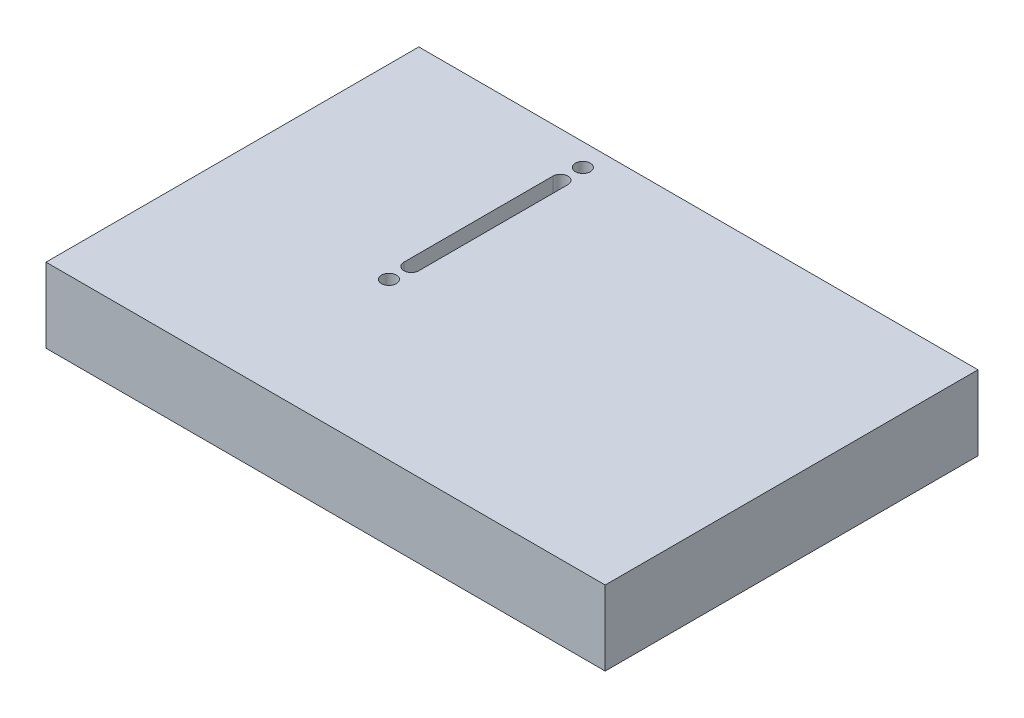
ISO-10303-21;
HEADER;
FILE_DESCRIPTION(('STEP AP214'),'2;1');
FILE_NAME('part.step','',(''),(''),'','','');
FILE_SCHEMA(('AUTOMOTIVE_DESIGN { 1 0 10303 214 1 1 1 1 }'));
ENDSEC;
DATA;
#1=APPLICATION_CONTEXT('core data for automotive mechanical design processes');
#2=APPLICATION_PROTOCOL_DEFINITION('international standard','automotive_design',2000,#1);
#3=PRODUCT_CONTEXT('',#1,'mechanical');
#4=PRODUCT('Part','Part','',(#3));
#5=PRODUCT_RELATED_PRODUCT_CATEGORY('part','',(#4));
#6=PRODUCT_DEFINITION_FORMATION('','',#4);
#7=PRODUCT_DEFINITION_CONTEXT('part definition',#1,'design');
#8=PRODUCT_DEFINITION('design','',#6,#7);
#9=PRODUCT_DEFINITION_SHAPE('','',#8);
#10=(LENGTH_UNIT() NAMED_UNIT(*) SI_UNIT(.MILLI.,.METRE.));
#11=(NAMED_UNIT(*) PLANE_ANGLE_UNIT() SI_UNIT($,.RADIAN.));
#12=(NAMED_UNIT(*) SI_UNIT($,.STERADIAN.) SOLID_ANGLE_UNIT());
#13=UNCERTAINTY_MEASURE_WITH_UNIT(LENGTH_MEASURE(1.E-05),#10,'distance_accuracy_value','');
#14=(GEOMETRIC_REPRESENTATION_CONTEXT(3) GLOBAL_UNCERTAINTY_ASSIGNED_CONTEXT((#13)) GLOBAL_UNIT_ASSIGNED_CONTEXT((#10,
#11,#12)) REPRESENTATION_CONTEXT('',''));
#15=CARTESIAN_POINT('',(0.,0.,0.));
#16=DIRECTION('',(0.,0.,1.));
#17=DIRECTION('',(1.,0.,0.));
#18=AXIS2_PLACEMENT_3D('',#15,#16,#17);
#19=CARTESIAN_POINT('',(9.525,2.54,6.35));
#20=DIRECTION('',(-1.,0.,0.));
#21=DIRECTION('',(0.,0.,1.));
#22=AXIS2_PLACEMENT_3D('',#19,#20,#21);
#23=PLANE('',#22);
#24=DIRECTION('',(0.,0.,-1.));
#25=VECTOR('',#24,1.);
#26=CARTESIAN_POINT('',(9.525,0.,6.35));
#27=LINE('',#26,#25);
#28=CARTESIAN_POINT('',(9.525,0.,6.35));
#29=VERTEX_POINT('',#28);
#30=CARTESIAN_POINT('',(9.525,0.,-6.35));
#31=VERTEX_POINT('',#30);
#32=EDGE_CURVE('E134',#29,#31,#27,.T.);
#33=ORIENTED_EDGE('',*,*,#32,.T.);
#34=DIRECTION('',(0.,-1.,0.));
#35=VECTOR('',#34,1.);
#36=CARTESIAN_POINT('',(9.525,2.54,-6.35));
#37=LINE('',#36,#35);
#38=CARTESIAN_POINT('',(9.525,2.54,-6.35));
#39=VERTEX_POINT('',#38);
#40=EDGE_CURVE('E11',#39,#31,#37,.T.);
#41=ORIENTED_EDGE('',*,*,#40,.F.);
#42=DIRECTION('',(0.,0.,-1.));
#43=VECTOR('',#42,1.);
#44=CARTESIAN_POINT('',(9.525,2.54,6.35));
#45=LINE('',#44,#43);
#46=CARTESIAN_POINT('',(9.525,2.54,6.35));
#47=VERTEX_POINT('',#46);
#48=EDGE_CURVE('E138',#47,#39,#45,.T.);
#49=ORIENTED_EDGE('',*,*,#48,.F.);
#50=DIRECTION('',(0.,-1.,0.));
#51=VECTOR('',#50,1.);
#52=CARTESIAN_POINT('',(9.525,2.54,6.35));
#53=LINE('',#52,#51);
#54=EDGE_CURVE('E148',#47,#29,#53,.T.);
#55=ORIENTED_EDGE('',*,*,#54,.T.);
#56=EDGE_LOOP('',(#33,#41,#49,#55));
#57=FACE_BOUND('',#56,.T.);
#58=ADVANCED_FACE('F33',(#57),#23,.F.);
#59=CARTESIAN_POINT('',(-9.525,2.54,-6.35));
#60=DIRECTION('',(0.,0.,1.));
#61=DIRECTION('',(1.,0.,0.));
#62=AXIS2_PLACEMENT_3D('',#59,#60,#61);
#63=PLANE('',#62);
#64=DIRECTION('',(-1.,0.,0.));
#65=VECTOR('',#64,1.);
#66=CARTESIAN_POINT('',(-9.525,0.,-6.35));
#67=LINE('',#66,#65);
#68=CARTESIAN_POINT('',(-9.525,0.,-6.35));
#69=VERTEX_POINT('',#68);
#70=EDGE_CURVE('E151',#31,#69,#67,.T.);
#71=ORIENTED_EDGE('',*,*,#70,.T.);
#72=DIRECTION('',(0.,-1.,0.));
#73=VECTOR('',#72,1.);
#74=CARTESIAN_POINT('',(-9.525,2.54,-6.35));
#75=LINE('',#74,#73);
#76=CARTESIAN_POINT('',(-9.525,2.54,-6.35));
#77=VERTEX_POINT('',#76);
#78=EDGE_CURVE('E40',#77,#69,#75,.T.);
#79=ORIENTED_EDGE('',*,*,#78,.F.);
#80=DIRECTION('',(-1.,0.,0.));
#81=VECTOR('',#80,1.);
#82=CARTESIAN_POINT('',(-9.525,2.54,-6.35));
#83=LINE('',#82,#81);
#84=EDGE_CURVE('E141',#39,#77,#83,.T.);
#85=ORIENTED_EDGE('',*,*,#84,.F.);
#86=ORIENTED_EDGE('',*,*,#40,.T.);
#87=EDGE_LOOP('',(#71,#79,#85,#86));
#88=FACE_BOUND('',#87,.T.);
#89=ADVANCED_FACE('F179',(#88),#63,.F.);
#90=CARTESIAN_POINT('',(-9.525,2.54,6.35));
#91=DIRECTION('',(1.,0.,0.));
#92=DIRECTION('',(0.,0.,-1.));
#93=AXIS2_PLACEMENT_3D('',#90,#91,#92);
#94=PLANE('',#93);
#95=DIRECTION('',(0.,0.,1.));
#96=VECTOR('',#95,1.);
#97=CARTESIAN_POINT('',(-9.525,0.,6.35));
#98=LINE('',#97,#96);
#99=CARTESIAN_POINT('',(-9.525,0.,6.35));
#100=VERTEX_POINT('',#99);
#101=EDGE_CURVE('E153',#69,#100,#98,.T.);
#102=ORIENTED_EDGE('',*,*,#101,.T.);
#103=DIRECTION('',(0.,-1.,0.));
#104=VECTOR('',#103,1.);
#105=CARTESIAN_POINT('',(-9.525,2.54,6.35));
#106=LINE('',#105,#104);
#107=CARTESIAN_POINT('',(-9.525,2.54,6.35));
#108=VERTEX_POINT('',#107);
#109=EDGE_CURVE('E158',#108,#100,#106,.T.);
#110=ORIENTED_EDGE('',*,*,#109,.F.);
#111=DIRECTION('',(0.,0.,1.));
#112=VECTOR('',#111,1.);
#113=CARTESIAN_POINT('',(-9.525,2.54,6.35));
#114=LINE('',#113,#112);
#115=EDGE_CURVE('E144',#77,#108,#114,.T.);
#116=ORIENTED_EDGE('',*,*,#115,.F.);
#117=ORIENTED_EDGE('',*,*,#78,.T.);
#118=EDGE_LOOP('',(#102,#110,#116,#117));
#119=FACE_BOUND('',#118,.T.);
#120=ADVANCED_FACE('F165',(#119),#94,.F.);
#121=CARTESIAN_POINT('',(-9.525,2.54,6.35));
#122=DIRECTION('',(0.,0.,-1.));
#123=DIRECTION('',(-1.,0.,0.));
#124=AXIS2_PLACEMENT_3D('',#121,#122,#123);
#125=PLANE('',#124);
#126=DIRECTION('',(1.,0.,0.));
#127=VECTOR('',#126,1.);
#128=CARTESIAN_POINT('',(-9.525,0.,6.35));
#129=LINE('',#128,#127);
#130=EDGE_CURVE('E142',#100,#29,#129,.T.);
#131=ORIENTED_EDGE('',*,*,#130,.T.);
#132=ORIENTED_EDGE('',*,*,#54,.F.);
#133=DIRECTION('',(1.,0.,0.));
#134=VECTOR('',#133,1.);
#135=CARTESIAN_POINT('',(-9.525,2.54,6.35));
#136=LINE('',#135,#134);
#137=EDGE_CURVE('E146',#108,#47,#136,.T.);
#138=ORIENTED_EDGE('',*,*,#137,.F.);
#139=ORIENTED_EDGE('',*,*,#109,.T.);
#140=EDGE_LOOP('',(#131,#132,#138,#139));
#141=FACE_BOUND('',#140,.T.);
#142=ADVANCED_FACE('F172',(#141),#125,.F.);
#143=CARTESIAN_POINT('',(0.,2.54,0.));
#144=DIRECTION('',(0.,-1.,0.));
#145=DIRECTION('',(0.,0.,-1.));
#146=AXIS2_PLACEMENT_3D('',#143,#144,#145);
#147=PLANE('',#146);
#148=CARTESIAN_POINT('',(-3.175,2.54,-5.588));
#149=DIRECTION('',(0.,1.,0.));
#150=DIRECTION('',(0.,0.,-1.));
#151=AXIS2_PLACEMENT_3D('',#148,#149,#150);
#152=CIRCLE('',#151,0.254);
#153=CARTESIAN_POINT('',(-3.175,2.54,-5.842));
#154=VERTEX_POINT('',#153);
#155=EDGE_CURVE('E221',#154,#154,#152,.T.);
#156=ORIENTED_EDGE('',*,*,#155,.F.);
#157=EDGE_LOOP('',(#156));
#158=FACE_BOUND('',#157,.T.);
#159=CARTESIAN_POINT('',(-3.175,2.54,1.016));
#160=DIRECTION('',(0.,1.,0.));
#161=DIRECTION('',(0.,0.,1.));
#162=AXIS2_PLACEMENT_3D('',#159,#160,#161);
#163=CIRCLE('',#162,0.254);
#164=CARTESIAN_POINT('',(-3.175,2.54,1.27));
#165=VERTEX_POINT('',#164);
#166=EDGE_CURVE('E121',#165,#165,#163,.T.);
#167=ORIENTED_EDGE('',*,*,#166,.F.);
#168=EDGE_LOOP('',(#167));
#169=FACE_BOUND('',#168,.T.);
#170=DIRECTION('',(0.,0.,1.));
#171=VECTOR('',#170,1.);
#172=CARTESIAN_POINT('',(-3.429,2.54,-4.826));
#173=LINE('',#172,#171);
#174=CARTESIAN_POINT('',(-3.429,2.54,-4.826));
#175=VERTEX_POINT('',#174);
#176=CARTESIAN_POINT('',(-3.429,2.54,0.254));
#177=VERTEX_POINT('',#176);
#178=EDGE_CURVE('E127',#175,#177,#173,.T.);
#179=ORIENTED_EDGE('',*,*,#178,.F.);
#180=CARTESIAN_POINT('',(-3.175,2.54,-4.826));
#181=DIRECTION('',(0.,1.,0.));
#182=DIRECTION('',(0.,0.,1.));
#183=AXIS2_PLACEMENT_3D('',#180,#181,#182);
#184=CIRCLE('',#183,0.254);
#185=CARTESIAN_POINT('',(-2.921,2.54,-4.826));
#186=VERTEX_POINT('',#185);
#187=EDGE_CURVE('E47',#186,#175,#184,.T.);
#188=ORIENTED_EDGE('',*,*,#187,.F.);
#189=DIRECTION('',(0.,0.,-1.));
#190=VECTOR('',#189,1.);
#191=CARTESIAN_POINT('',(-2.921,2.54,-4.826));
#192=LINE('',#191,#190);
#193=CARTESIAN_POINT('',(-2.921,2.54,0.254));
#194=VERTEX_POINT('',#193);
#195=EDGE_CURVE('E115',#194,#186,#192,.T.);
#196=ORIENTED_EDGE('',*,*,#195,.F.);
#197=CARTESIAN_POINT('',(-3.175,2.54,0.254));
#198=DIRECTION('',(0.,1.,0.));
#199=DIRECTION('',(0.,0.,1.));
#200=AXIS2_PLACEMENT_3D('',#197,#198,#199);
#201=CIRCLE('',#200,0.254);
#202=EDGE_CURVE('E118',#177,#194,#201,.T.);
#203=ORIENTED_EDGE('',*,*,#202,.F.);
#204=EDGE_LOOP('',(#179,#188,#196,#203));
#205=FACE_BOUND('',#204,.T.);
#206=ORIENTED_EDGE('',*,*,#48,.T.);
#207=ORIENTED_EDGE('',*,*,#84,.T.);
#208=ORIENTED_EDGE('',*,*,#115,.T.);
#209=ORIENTED_EDGE('',*,*,#137,.T.);
#210=EDGE_LOOP('',(#206,#207,#208,#209));
#211=FACE_BOUND('',#210,.T.);
#212=ADVANCED_FACE('F178',(#158,#169,#205,#211),#147,.F.);
#213=CARTESIAN_POINT('',(0.,0.,0.));
#214=DIRECTION('',(0.,-1.,0.));
#215=DIRECTION('',(0.,0.,-1.));
#216=AXIS2_PLACEMENT_3D('',#213,#214,#215);
#217=PLANE('',#216);
#218=CARTESIAN_POINT('',(-3.175,0.,-5.588));
#219=DIRECTION('',(0.,1.,0.));
#220=DIRECTION('',(0.,0.,-1.));
#221=AXIS2_PLACEMENT_3D('',#218,#219,#220);
#222=CIRCLE('',#221,0.254);
#223=CARTESIAN_POINT('',(-3.175,0.,-5.842));
#224=VERTEX_POINT('',#223);
#225=EDGE_CURVE('E218',#224,#224,#222,.T.);
#226=ORIENTED_EDGE('',*,*,#225,.T.);
#227=EDGE_LOOP('',(#226));
#228=FACE_BOUND('',#227,.T.);
#229=CARTESIAN_POINT('',(-3.175,0.,1.016));
#230=DIRECTION('',(0.,1.,0.));
#231=DIRECTION('',(0.,0.,1.));
#232=AXIS2_PLACEMENT_3D('',#229,#230,#231);
#233=CIRCLE('',#232,0.254);
#234=CARTESIAN_POINT('',(-3.175,0.,1.27));
#235=VERTEX_POINT('',#234);
#236=EDGE_CURVE('E128',#235,#235,#233,.T.);
#237=ORIENTED_EDGE('',*,*,#236,.T.);
#238=EDGE_LOOP('',(#237));
#239=FACE_BOUND('',#238,.T.);
#240=CARTESIAN_POINT('',(-3.175,0.,-4.826));
#241=DIRECTION('',(0.,1.,0.));
#242=DIRECTION('',(0.,0.,1.));
#243=AXIS2_PLACEMENT_3D('',#240,#241,#242);
#244=CIRCLE('',#243,0.254);
#245=CARTESIAN_POINT('',(-2.921,0.,-4.826));
#246=VERTEX_POINT('',#245);
#247=CARTESIAN_POINT('',(-3.429,0.,-4.826));
#248=VERTEX_POINT('',#247);
#249=EDGE_CURVE('E99',#246,#248,#244,.T.);
#250=ORIENTED_EDGE('',*,*,#249,.T.);
#251=DIRECTION('',(0.,0.,1.));
#252=VECTOR('',#251,1.);
#253=CARTESIAN_POINT('',(-3.429,0.,-4.826));
#254=LINE('',#253,#252);
#255=CARTESIAN_POINT('',(-3.429,0.,0.254));
#256=VERTEX_POINT('',#255);
#257=EDGE_CURVE('E108',#248,#256,#254,.T.);
#258=ORIENTED_EDGE('',*,*,#257,.T.);
#259=CARTESIAN_POINT('',(-3.175,0.,0.254));
#260=DIRECTION('',(0.,1.,0.));
#261=DIRECTION('',(0.,0.,1.));
#262=AXIS2_PLACEMENT_3D('',#259,#260,#261);
#263=CIRCLE('',#262,0.254);
#264=CARTESIAN_POINT('',(-2.921,0.,0.254));
#265=VERTEX_POINT('',#264);
#266=EDGE_CURVE('E55',#256,#265,#263,.T.);
#267=ORIENTED_EDGE('',*,*,#266,.T.);
#268=DIRECTION('',(0.,0.,-1.));
#269=VECTOR('',#268,1.);
#270=CARTESIAN_POINT('',(-2.921,0.,-4.826));
#271=LINE('',#270,#269);
#272=EDGE_CURVE('E105',#265,#246,#271,.T.);
#273=ORIENTED_EDGE('',*,*,#272,.T.);
#274=EDGE_LOOP('',(#250,#258,#267,#273));
#275=FACE_BOUND('',#274,.T.);
#276=ORIENTED_EDGE('',*,*,#32,.F.);
#277=ORIENTED_EDGE('',*,*,#130,.F.);
#278=ORIENTED_EDGE('',*,*,#101,.F.);
#279=ORIENTED_EDGE('',*,*,#70,.F.);
#280=EDGE_LOOP('',(#276,#277,#278,#279));
#281=FACE_BOUND('',#280,.T.);
#282=ADVANCED_FACE('F112',(#228,#239,#275,#281),#217,.T.);
#283=CARTESIAN_POINT('',(-3.175,0.,-4.826));
#284=DIRECTION('',(0.,1.,0.));
#285=DIRECTION('',(0.,0.,1.));
#286=AXIS2_PLACEMENT_3D('',#283,#284,#285);
#287=CYLINDRICAL_SURFACE('',#286,0.254);
#288=ORIENTED_EDGE('',*,*,#187,.T.);
#289=DIRECTION('',(0.,1.,0.));
#290=VECTOR('',#289,1.);
#291=CARTESIAN_POINT('',(-3.429,0.,-4.826));
#292=LINE('',#291,#290);
#293=EDGE_CURVE('E95',#248,#175,#292,.T.);
#294=ORIENTED_EDGE('',*,*,#293,.F.);
#295=ORIENTED_EDGE('',*,*,#249,.F.);
#296=DIRECTION('',(0.,1.,0.));
#297=VECTOR('',#296,1.);
#298=CARTESIAN_POINT('',(-2.921,0.,-4.826));
#299=LINE('',#298,#297);
#300=EDGE_CURVE('E132',#246,#186,#299,.T.);
#301=ORIENTED_EDGE('',*,*,#300,.T.);
#302=EDGE_LOOP('',(#288,#294,#295,#301));
#303=FACE_BOUND('',#302,.T.);
#304=ADVANCED_FACE('F97',(#303),#287,.F.);
#305=CARTESIAN_POINT('',(-2.921,0.,-4.826));
#306=DIRECTION('',(1.,0.,0.));
#307=DIRECTION('',(0.,0.,-1.));
#308=AXIS2_PLACEMENT_3D('',#305,#306,#307);
#309=PLANE('',#308);
#310=ORIENTED_EDGE('',*,*,#195,.T.);
#311=ORIENTED_EDGE('',*,*,#300,.F.);
#312=ORIENTED_EDGE('',*,*,#272,.F.);
#313=DIRECTION('',(0.,1.,0.));
#314=VECTOR('',#313,1.);
#315=CARTESIAN_POINT('',(-2.921,0.,0.254));
#316=LINE('',#315,#314);
#317=EDGE_CURVE('E135',#265,#194,#316,.T.);
#318=ORIENTED_EDGE('',*,*,#317,.T.);
#319=EDGE_LOOP('',(#310,#311,#312,#318));
#320=FACE_BOUND('',#319,.T.);
#321=ADVANCED_FACE('F197',(#320),#309,.F.);
#322=CARTESIAN_POINT('',(-3.175,0.,0.254));
#323=DIRECTION('',(0.,1.,0.));
#324=DIRECTION('',(0.,0.,1.));
#325=AXIS2_PLACEMENT_3D('',#322,#323,#324);
#326=CYLINDRICAL_SURFACE('',#325,0.254);
#327=ORIENTED_EDGE('',*,*,#202,.T.);
#328=ORIENTED_EDGE('',*,*,#317,.F.);
#329=ORIENTED_EDGE('',*,*,#266,.F.);
#330=DIRECTION('',(0.,1.,0.));
#331=VECTOR('',#330,1.);
#332=CARTESIAN_POINT('',(-3.429,0.,0.254));
#333=LINE('',#332,#331);
#334=EDGE_CURVE('E104',#256,#177,#333,.T.);
#335=ORIENTED_EDGE('',*,*,#334,.T.);
#336=EDGE_LOOP('',(#327,#328,#329,#335));
#337=FACE_BOUND('',#336,.T.);
#338=ADVANCED_FACE('F201',(#337),#326,.F.);
#339=CARTESIAN_POINT('',(-3.429,0.,-4.826));
#340=DIRECTION('',(-1.,0.,0.));
#341=DIRECTION('',(0.,0.,1.));
#342=AXIS2_PLACEMENT_3D('',#339,#340,#341);
#343=PLANE('',#342);
#344=ORIENTED_EDGE('',*,*,#178,.T.);
#345=ORIENTED_EDGE('',*,*,#334,.F.);
#346=ORIENTED_EDGE('',*,*,#257,.F.);
#347=ORIENTED_EDGE('',*,*,#293,.T.);
#348=EDGE_LOOP('',(#344,#345,#346,#347));
#349=FACE_BOUND('',#348,.T.);
#350=ADVANCED_FACE('F109',(#349),#343,.F.);
#351=CARTESIAN_POINT('',(-3.175,0.,1.016));
#352=DIRECTION('',(0.,1.,0.));
#353=DIRECTION('',(0.,0.,1.));
#354=AXIS2_PLACEMENT_3D('',#351,#352,#353);
#355=CYLINDRICAL_SURFACE('',#354,0.254);
#356=ORIENTED_EDGE('',*,*,#236,.F.);
#357=EDGE_LOOP('',(#356));
#358=FACE_BOUND('',#357,.T.);
#359=ORIENTED_EDGE('',*,*,#166,.T.);
#360=EDGE_LOOP('',(#359));
#361=FACE_BOUND('',#360,.T.);
#362=ADVANCED_FACE('F200',(#358,#361),#355,.F.);
#363=CARTESIAN_POINT('',(-3.175,0.,-5.588));
#364=DIRECTION('',(0.,1.,0.));
#365=DIRECTION('',(0.,0.,1.));
#366=AXIS2_PLACEMENT_3D('',#363,#364,#365);
#367=CYLINDRICAL_SURFACE('',#366,0.254);
#368=ORIENTED_EDGE('',*,*,#225,.F.);
#369=EDGE_LOOP('',(#368));
#370=FACE_BOUND('',#369,.T.);
#371=ORIENTED_EDGE('',*,*,#155,.T.);
#372=EDGE_LOOP('',(#371));
#373=FACE_BOUND('',#372,.T.);
#374=ADVANCED_FACE('F209',(#370,#373),#367,.F.);
#375=CLOSED_SHELL('',(#58,#89,#120,#142,#212,#282,#304,#321,#338,#350,#362,#374));
#376=MANIFOLD_SOLID_BREP('B2',#375);
#377=ADVANCED_BREP_SHAPE_REPRESENTATION('',(#18,#376),#14);
#378=SHAPE_DEFINITION_REPRESENTATION(#9,#377);
ENDSEC;
END-ISO-10303-21;
